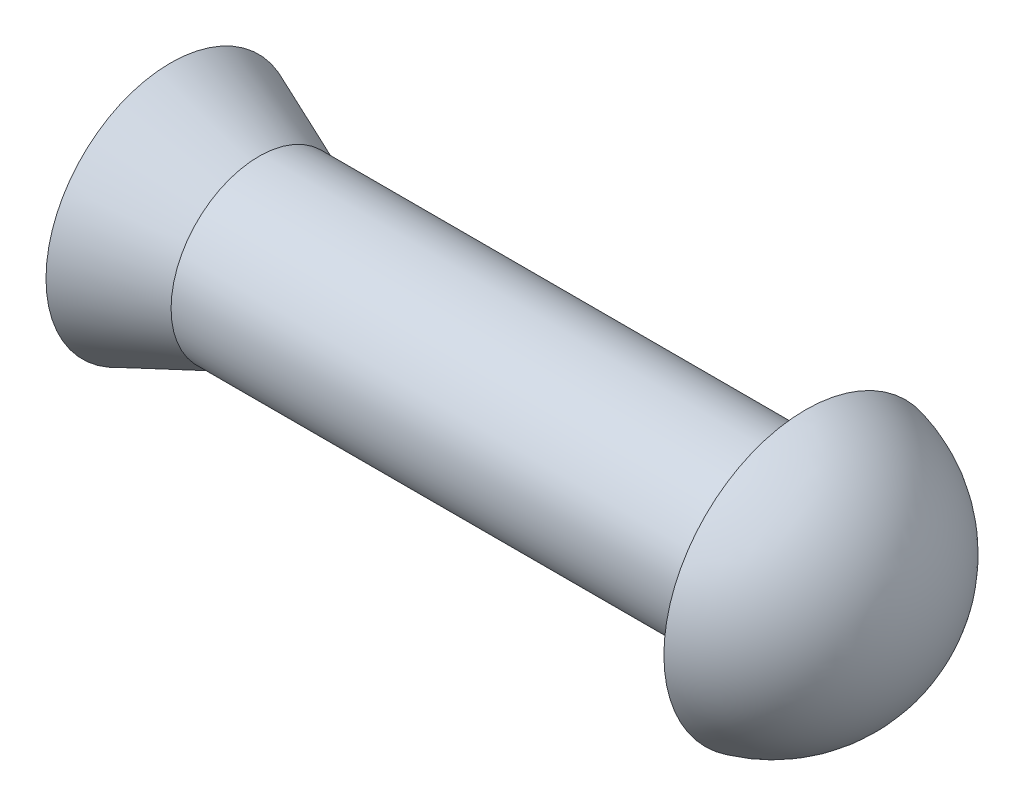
ISO-10303-21;
HEADER;
FILE_DESCRIPTION(('STEP AP214'),'2;1');
FILE_NAME('part.step','',(''),(''),'','','');
FILE_SCHEMA(('AUTOMOTIVE_DESIGN { 1 0 10303 214 1 1 1 1 }'));
ENDSEC;
DATA;
#1=APPLICATION_CONTEXT('core data for automotive mechanical design processes');
#2=APPLICATION_PROTOCOL_DEFINITION('international standard','automotive_design',2000,#1);
#3=PRODUCT_CONTEXT('',#1,'mechanical');
#4=PRODUCT('Part','Part','',(#3));
#5=PRODUCT_RELATED_PRODUCT_CATEGORY('part','',(#4));
#6=PRODUCT_DEFINITION_FORMATION('','',#4);
#7=PRODUCT_DEFINITION_CONTEXT('part definition',#1,'design');
#8=PRODUCT_DEFINITION('design','',#6,#7);
#9=PRODUCT_DEFINITION_SHAPE('','',#8);
#10=(LENGTH_UNIT() NAMED_UNIT(*) SI_UNIT(.MILLI.,.METRE.));
#11=(NAMED_UNIT(*) PLANE_ANGLE_UNIT() SI_UNIT($,.RADIAN.));
#12=(NAMED_UNIT(*) SI_UNIT($,.STERADIAN.) SOLID_ANGLE_UNIT());
#13=UNCERTAINTY_MEASURE_WITH_UNIT(LENGTH_MEASURE(1.E-05),#10,'distance_accuracy_value','');
#14=(GEOMETRIC_REPRESENTATION_CONTEXT(3) GLOBAL_UNCERTAINTY_ASSIGNED_CONTEXT((#13)) GLOBAL_UNIT_ASSIGNED_CONTEXT((#10,
#11,#12)) REPRESENTATION_CONTEXT('',''));
#15=CARTESIAN_POINT('',(0.,0.,0.));
#16=DIRECTION('',(0.,0.,1.));
#17=DIRECTION('',(1.,0.,0.));
#18=AXIS2_PLACEMENT_3D('',#15,#16,#17);
#19=CARTESIAN_POINT('',(-39.,0.,0.));
#20=DIRECTION('',(-1.,0.,0.));
#21=DIRECTION('',(0.,0.,1.));
#22=AXIS2_PLACEMENT_3D('',#19,#20,#21);
#23=CYLINDRICAL_SURFACE('',#22,18.);
#24=CARTESIAN_POINT('',(-111.893398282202,0.,0.));
#25=DIRECTION('',(-1.,0.,0.));
#26=DIRECTION('',(0.,0.,1.));
#27=AXIS2_PLACEMENT_3D('',#24,#25,#26);
#28=CIRCLE('',#27,18.);
#29=CARTESIAN_POINT('',(-111.893398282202,0.,18.));
#30=VERTEX_POINT('',#29);
#31=EDGE_CURVE('E10',#30,#30,#28,.T.);
#32=ORIENTED_EDGE('',*,*,#31,.F.);
#33=EDGE_LOOP('',(#32));
#34=FACE_BOUND('',#33,.T.);
#35=CARTESIAN_POINT('',(0.,0.,0.));
#36=DIRECTION('',(1.,0.,0.));
#37=DIRECTION('',(0.,0.,-1.));
#38=AXIS2_PLACEMENT_3D('',#35,#36,#37);
#39=CIRCLE('',#38,18.);
#40=CARTESIAN_POINT('',(0.,0.,-18.));
#41=VERTEX_POINT('',#40);
#42=EDGE_CURVE('E41',#41,#41,#39,.T.);
#43=ORIENTED_EDGE('',*,*,#42,.F.);
#44=EDGE_LOOP('',(#43));
#45=FACE_BOUND('',#44,.T.);
#46=ADVANCED_FACE('F31',(#34,#45),#23,.T.);
#47=CARTESIAN_POINT('',(-111.893398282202,0.,0.));
#48=DIRECTION('',(-1.,0.,0.));
#49=DIRECTION('',(0.,0.,1.));
#50=AXIS2_PLACEMENT_3D('',#47,#48,#49);
#51=CONICAL_SURFACE('',#50,18.,0.392699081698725);
#52=CARTESIAN_POINT('',(-130.,0.,0.));
#53=DIRECTION('',(-1.,0.,0.));
#54=DIRECTION('',(0.,0.,1.));
#55=AXIS2_PLACEMENT_3D('',#52,#53,#54);
#56=CIRCLE('',#55,25.5);
#57=CARTESIAN_POINT('',(-130.,0.,25.5));
#58=VERTEX_POINT('',#57);
#59=EDGE_CURVE('E37',#58,#58,#56,.T.);
#60=ORIENTED_EDGE('',*,*,#59,.F.);
#61=EDGE_LOOP('',(#60));
#62=FACE_BOUND('',#61,.T.);
#63=ORIENTED_EDGE('',*,*,#31,.T.);
#64=EDGE_LOOP('',(#63));
#65=FACE_BOUND('',#64,.T.);
#66=ADVANCED_FACE('F63',(#62,#65),#51,.T.);
#67=CARTESIAN_POINT('',(38.0766194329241,0.,0.));
#68=DIRECTION('',(-1.,0.,0.));
#69=DIRECTION('',(0.,1.,0.));
#70=AXIS2_PLACEMENT_3D('',#67,#68,#69);
#71=SPHERICAL_SURFACE('',#70,170.);
#72=ORIENTED_EDGE('',*,*,#59,.T.);
#73=EDGE_LOOP('',(#72));
#74=FACE_BOUND('',#73,.T.);
#75=ADVANCED_FACE('F60',(#74),#71,.T.);
#76=CARTESIAN_POINT('',(0.,0.,0.));
#77=DIRECTION('',(1.,0.,0.));
#78=DIRECTION('',(0.,0.,-1.));
#79=AXIS2_PLACEMENT_3D('',#76,#77,#78);
#80=PLANE('',#79);
#81=CARTESIAN_POINT('',(0.,0.,0.));
#82=DIRECTION('',(-1.,0.,0.));
#83=DIRECTION('',(0.,0.,1.));
#84=AXIS2_PLACEMENT_3D('',#81,#82,#83);
#85=CIRCLE('',#84,29.);
#86=CARTESIAN_POINT('',(0.,0.,29.));
#87=VERTEX_POINT('',#86);
#88=EDGE_CURVE('E45',#87,#87,#85,.T.);
#89=ORIENTED_EDGE('',*,*,#88,.T.);
#90=EDGE_LOOP('',(#89));
#91=FACE_BOUND('',#90,.T.);
#92=ORIENTED_EDGE('',*,*,#42,.T.);
#93=EDGE_LOOP('',(#92));
#94=FACE_BOUND('',#93,.T.);
#95=ADVANCED_FACE('F51',(#91,#94),#80,.F.);
#96=CARTESIAN_POINT('',(-6.78260869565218,0.,0.));
#97=DIRECTION('',(-1.,0.,0.));
#98=DIRECTION('',(0.,1.,0.));
#99=AXIS2_PLACEMENT_3D('',#96,#97,#98);
#100=SPHERICAL_SURFACE('',#99,29.7826086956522);
#101=ORIENTED_EDGE('',*,*,#88,.F.);
#102=EDGE_LOOP('',(#101));
#103=FACE_BOUND('',#102,.T.);
#104=ADVANCED_FACE('F54',(#103),#100,.T.);
#105=CLOSED_SHELL('',(#46,#66,#75,#95,#104));
#106=MANIFOLD_SOLID_BREP('B2',#105);
#107=ADVANCED_BREP_SHAPE_REPRESENTATION('',(#18,#106),#14);
#108=SHAPE_DEFINITION_REPRESENTATION(#9,#107);
ENDSEC;
END-ISO-10303-21;
